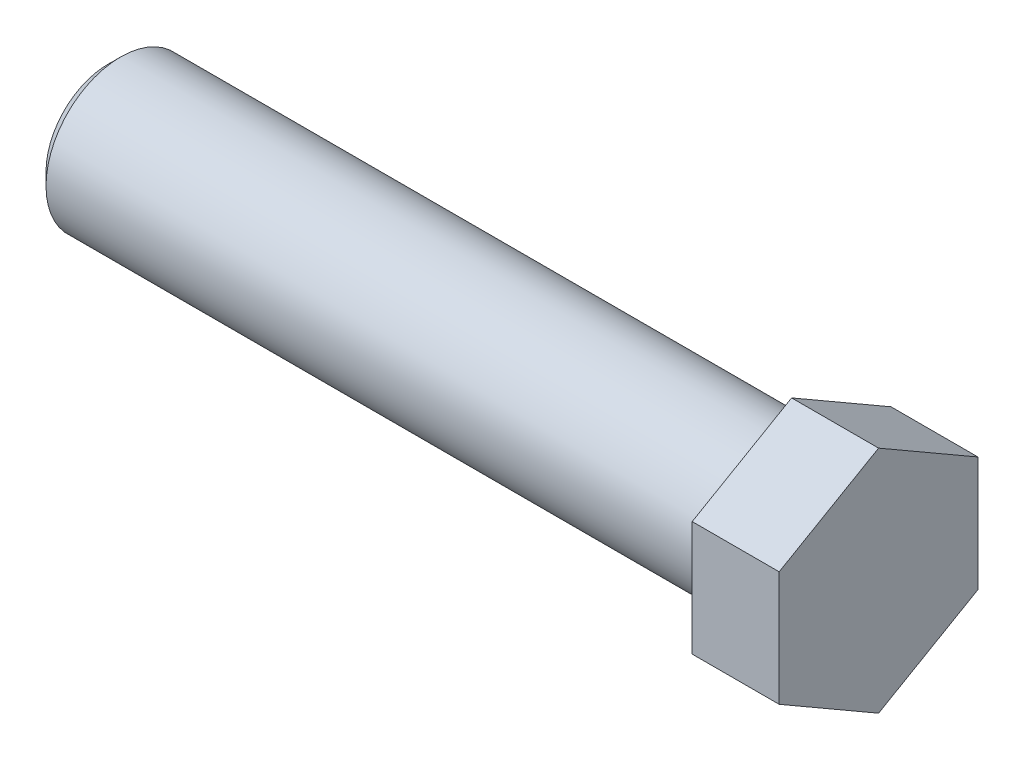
from build123d import *

# Parameters (mm, degrees)
ESQUISSE1_W        = 55
ESQUISSE1_H        = 6
CHANFREIN1_SIZE    = 1
BOSS_EXTRU_1_DEPTH = 7


with BuildPart() as part:
    # Esquisse1 → Base-R_volution (revolve)
    with BuildSketch(Plane.XY, mode=Mode.PRIVATE) as base_r_volution_sk:
        with Locations((-27.5, 3)):
            Rectangle(ESQUISSE1_W, ESQUISSE1_H)
    revolve(base_r_volution_sk.sketch.rotate(Axis((30, 0, 0), (-1, 0, 0)), 90), axis=Axis((30, 0, 0), (-1, 0, 0)))

    # Chanfrein1
    chanfrein1_edges = [part.edges().sort_by_distance(p)[0] for p in [
        (-55, 0, 6),
    ]]
    chamfer(chanfrein1_edges, length=CHANFREIN1_SIZE)

    # Esquisse2 → Boss.-Extru.1 (add)
    with BuildSketch(Plane(origin=(0, 0, 0), x_dir=(0, 0, -1), z_dir=(1, 0, 0))):
        Polygon((8, -4.618802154), (8, 4.618802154), (0, 9.237604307), (-8, 4.618802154), (-8, -4.618802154), (0, -9.237604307), align=None)
    extrude(amount=BOSS_EXTRU_1_DEPTH)


solid = part.part
